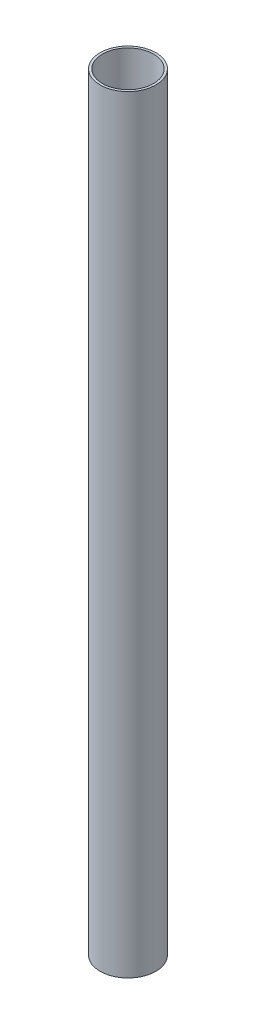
ISO-10303-21;
HEADER;
FILE_DESCRIPTION(('STEP AP214'),'2;1');
FILE_NAME('part.step','',(''),(''),'','','');
FILE_SCHEMA(('AUTOMOTIVE_DESIGN { 1 0 10303 214 1 1 1 1 }'));
ENDSEC;
DATA;
#1=APPLICATION_CONTEXT('core data for automotive mechanical design processes');
#2=APPLICATION_PROTOCOL_DEFINITION('international standard','automotive_design',2000,#1);
#3=PRODUCT_CONTEXT('',#1,'mechanical');
#4=PRODUCT('Part','Part','',(#3));
#5=PRODUCT_RELATED_PRODUCT_CATEGORY('part','',(#4));
#6=PRODUCT_DEFINITION_FORMATION('','',#4);
#7=PRODUCT_DEFINITION_CONTEXT('part definition',#1,'design');
#8=PRODUCT_DEFINITION('design','',#6,#7);
#9=PRODUCT_DEFINITION_SHAPE('','',#8);
#10=(LENGTH_UNIT() NAMED_UNIT(*) SI_UNIT(.MILLI.,.METRE.));
#11=(NAMED_UNIT(*) PLANE_ANGLE_UNIT() SI_UNIT($,.RADIAN.));
#12=(NAMED_UNIT(*) SI_UNIT($,.STERADIAN.) SOLID_ANGLE_UNIT());
#13=UNCERTAINTY_MEASURE_WITH_UNIT(LENGTH_MEASURE(1.E-05),#10,'distance_accuracy_value','');
#14=(GEOMETRIC_REPRESENTATION_CONTEXT(3) GLOBAL_UNCERTAINTY_ASSIGNED_CONTEXT((#13)) GLOBAL_UNIT_ASSIGNED_CONTEXT((#10,
#11,#12)) REPRESENTATION_CONTEXT('',''));
#15=CARTESIAN_POINT('',(0.,0.,0.));
#16=DIRECTION('',(0.,0.,1.));
#17=DIRECTION('',(1.,0.,0.));
#18=AXIS2_PLACEMENT_3D('',#15,#16,#17);
#19=CARTESIAN_POINT('',(0.,-330.,0.));
#20=DIRECTION('',(0.,1.,0.));
#21=DIRECTION('',(0.,0.,1.));
#22=AXIS2_PLACEMENT_3D('',#19,#20,#21);
#23=CYLINDRICAL_SURFACE('',#22,12.);
#24=CARTESIAN_POINT('',(0.,-330.,0.));
#25=DIRECTION('',(0.,1.,0.));
#26=DIRECTION('',(0.,0.,1.));
#27=AXIS2_PLACEMENT_3D('',#24,#25,#26);
#28=CIRCLE('',#27,12.);
#29=CARTESIAN_POINT('',(0.,-330.,12.));
#30=VERTEX_POINT('',#29);
#31=EDGE_CURVE('E10',#30,#30,#28,.T.);
#32=ORIENTED_EDGE('',*,*,#31,.T.);
#33=EDGE_LOOP('',(#32));
#34=FACE_BOUND('',#33,.T.);
#35=CARTESIAN_POINT('',(0.,0.,0.));
#36=DIRECTION('',(0.,1.,0.));
#37=DIRECTION('',(0.,0.,1.));
#38=AXIS2_PLACEMENT_3D('',#35,#36,#37);
#39=CIRCLE('',#38,12.);
#40=CARTESIAN_POINT('',(0.,0.,12.));
#41=VERTEX_POINT('',#40);
#42=EDGE_CURVE('E40',#41,#41,#39,.T.);
#43=ORIENTED_EDGE('',*,*,#42,.F.);
#44=EDGE_LOOP('',(#43));
#45=FACE_BOUND('',#44,.T.);
#46=ADVANCED_FACE('F37',(#34,#45),#23,.T.);
#47=CARTESIAN_POINT('',(0.,-330.,0.));
#48=DIRECTION('',(0.,1.,0.));
#49=DIRECTION('',(0.,0.,1.));
#50=AXIS2_PLACEMENT_3D('',#47,#48,#49);
#51=PLANE('',#50);
#52=CARTESIAN_POINT('',(0.,-330.,0.));
#53=DIRECTION('',(0.,1.,0.));
#54=DIRECTION('',(0.,0.,1.));
#55=AXIS2_PLACEMENT_3D('',#52,#53,#54);
#56=CIRCLE('',#55,11.);
#57=CARTESIAN_POINT('',(0.,-330.,11.));
#58=VERTEX_POINT('',#57);
#59=EDGE_CURVE('E47',#58,#58,#56,.T.);
#60=ORIENTED_EDGE('',*,*,#59,.T.);
#61=EDGE_LOOP('',(#60));
#62=FACE_BOUND('',#61,.T.);
#63=ORIENTED_EDGE('',*,*,#31,.F.);
#64=EDGE_LOOP('',(#63));
#65=FACE_BOUND('',#64,.T.);
#66=ADVANCED_FACE('F55',(#62,#65),#51,.F.);
#67=CARTESIAN_POINT('',(0.,0.,0.));
#68=DIRECTION('',(0.,1.,0.));
#69=DIRECTION('',(0.,0.,1.));
#70=AXIS2_PLACEMENT_3D('',#67,#68,#69);
#71=PLANE('',#70);
#72=CARTESIAN_POINT('',(0.,0.,0.));
#73=DIRECTION('',(0.,1.,0.));
#74=DIRECTION('',(0.,0.,1.));
#75=AXIS2_PLACEMENT_3D('',#72,#73,#74);
#76=CIRCLE('',#75,11.);
#77=CARTESIAN_POINT('',(0.,0.,11.));
#78=VERTEX_POINT('',#77);
#79=EDGE_CURVE('E49',#78,#78,#76,.T.);
#80=ORIENTED_EDGE('',*,*,#79,.F.);
#81=EDGE_LOOP('',(#80));
#82=FACE_BOUND('',#81,.T.);
#83=ORIENTED_EDGE('',*,*,#42,.T.);
#84=EDGE_LOOP('',(#83));
#85=FACE_BOUND('',#84,.T.);
#86=ADVANCED_FACE('F61',(#82,#85),#71,.T.);
#87=CARTESIAN_POINT('',(0.,-330.,0.));
#88=DIRECTION('',(0.,1.,0.));
#89=DIRECTION('',(0.,0.,1.));
#90=AXIS2_PLACEMENT_3D('',#87,#88,#89);
#91=CYLINDRICAL_SURFACE('',#90,11.);
#92=ORIENTED_EDGE('',*,*,#59,.F.);
#93=EDGE_LOOP('',(#92));
#94=FACE_BOUND('',#93,.T.);
#95=ORIENTED_EDGE('',*,*,#79,.T.);
#96=EDGE_LOOP('',(#95));
#97=FACE_BOUND('',#96,.T.);
#98=ADVANCED_FACE('F58',(#94,#97),#91,.F.);
#99=CLOSED_SHELL('',(#46,#66,#86,#98));
#100=MANIFOLD_SOLID_BREP('B2',#99);
#101=ADVANCED_BREP_SHAPE_REPRESENTATION('',(#18,#100),#14);
#102=SHAPE_DEFINITION_REPRESENTATION(#9,#101);
ENDSEC;
END-ISO-10303-21;
